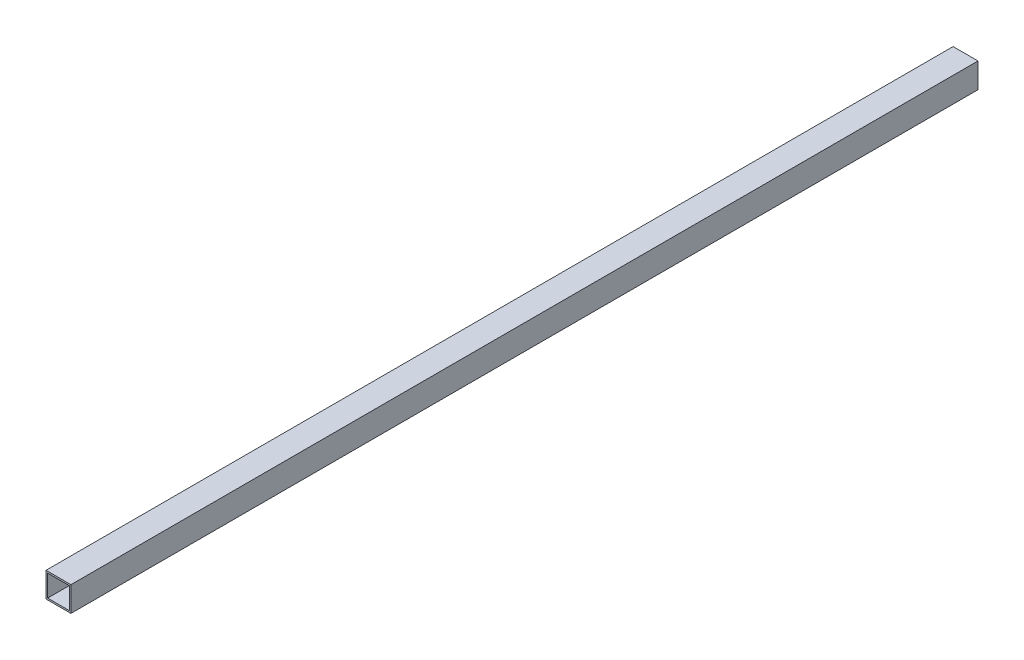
ISO-10303-21;
HEADER;
FILE_DESCRIPTION(('STEP AP214'),'2;1');
FILE_NAME('part.step','',(''),(''),'','','');
FILE_SCHEMA(('AUTOMOTIVE_DESIGN { 1 0 10303 214 1 1 1 1 }'));
ENDSEC;
DATA;
#1=APPLICATION_CONTEXT('core data for automotive mechanical design processes');
#2=APPLICATION_PROTOCOL_DEFINITION('international standard','automotive_design',2000,#1);
#3=PRODUCT_CONTEXT('',#1,'mechanical');
#4=PRODUCT('Part','Part','',(#3));
#5=PRODUCT_RELATED_PRODUCT_CATEGORY('part','',(#4));
#6=PRODUCT_DEFINITION_FORMATION('','',#4);
#7=PRODUCT_DEFINITION_CONTEXT('part definition',#1,'design');
#8=PRODUCT_DEFINITION('design','',#6,#7);
#9=PRODUCT_DEFINITION_SHAPE('','',#8);
#10=(LENGTH_UNIT() NAMED_UNIT(*) SI_UNIT(.MILLI.,.METRE.));
#11=(NAMED_UNIT(*) PLANE_ANGLE_UNIT() SI_UNIT($,.RADIAN.));
#12=(NAMED_UNIT(*) SI_UNIT($,.STERADIAN.) SOLID_ANGLE_UNIT());
#13=UNCERTAINTY_MEASURE_WITH_UNIT(LENGTH_MEASURE(1.E-05),#10,'distance_accuracy_value','');
#14=(GEOMETRIC_REPRESENTATION_CONTEXT(3) GLOBAL_UNCERTAINTY_ASSIGNED_CONTEXT((#13)) GLOBAL_UNIT_ASSIGNED_CONTEXT((#10,
#11,#12)) REPRESENTATION_CONTEXT('',''));
#15=CARTESIAN_POINT('',(0.,0.,0.));
#16=DIRECTION('',(0.,0.,1.));
#17=DIRECTION('',(1.,0.,0.));
#18=AXIS2_PLACEMENT_3D('',#15,#16,#17);
#19=CARTESIAN_POINT('',(-15.,-15.,1092.));
#20=DIRECTION('',(0.,0.,1.));
#21=DIRECTION('',(1.,0.,0.));
#22=AXIS2_PLACEMENT_3D('',#19,#20,#21);
#23=PLANE('',#22);
#24=DIRECTION('',(0.,-1.,0.));
#25=VECTOR('',#24,1.);
#26=CARTESIAN_POINT('',(-15.,15.,1092.));
#27=LINE('',#26,#25);
#28=CARTESIAN_POINT('',(-15.,15.,1092.));
#29=VERTEX_POINT('',#28);
#30=CARTESIAN_POINT('',(-15.,-15.,1092.));
#31=VERTEX_POINT('',#30);
#32=EDGE_CURVE('E155',#29,#31,#27,.T.);
#33=ORIENTED_EDGE('',*,*,#32,.T.);
#34=DIRECTION('',(1.,0.,0.));
#35=VECTOR('',#34,1.);
#36=CARTESIAN_POINT('',(-15.,-15.,1092.));
#37=LINE('',#36,#35);
#38=CARTESIAN_POINT('',(15.,-15.,1092.));
#39=VERTEX_POINT('',#38);
#40=EDGE_CURVE('E158',#31,#39,#37,.T.);
#41=ORIENTED_EDGE('',*,*,#40,.T.);
#42=DIRECTION('',(0.,1.,0.));
#43=VECTOR('',#42,1.);
#44=CARTESIAN_POINT('',(15.,15.,1092.));
#45=LINE('',#44,#43);
#46=CARTESIAN_POINT('',(15.,15.,1092.));
#47=VERTEX_POINT('',#46);
#48=EDGE_CURVE('E161',#39,#47,#45,.T.);
#49=ORIENTED_EDGE('',*,*,#48,.T.);
#50=DIRECTION('',(-1.,0.,0.));
#51=VECTOR('',#50,1.);
#52=CARTESIAN_POINT('',(-15.,15.,1092.));
#53=LINE('',#52,#51);
#54=EDGE_CURVE('E163',#47,#29,#53,.T.);
#55=ORIENTED_EDGE('',*,*,#54,.T.);
#56=EDGE_LOOP('',(#33,#41,#49,#55));
#57=FACE_BOUND('',#56,.T.);
#58=DIRECTION('',(1.,0.,0.));
#59=VECTOR('',#58,1.);
#60=CARTESIAN_POINT('',(-15.,-13.,1092.));
#61=LINE('',#60,#59);
#62=CARTESIAN_POINT('',(-13.,-13.,1092.));
#63=VERTEX_POINT('',#62);
#64=CARTESIAN_POINT('',(13.,-13.,1092.));
#65=VERTEX_POINT('',#64);
#66=EDGE_CURVE('E127',#63,#65,#61,.T.);
#67=ORIENTED_EDGE('',*,*,#66,.F.);
#68=DIRECTION('',(0.,-1.,0.));
#69=VECTOR('',#68,1.);
#70=CARTESIAN_POINT('',(-13.,15.,1092.));
#71=LINE('',#70,#69);
#72=CARTESIAN_POINT('',(-13.,13.,1092.));
#73=VERTEX_POINT('',#72);
#74=EDGE_CURVE('E119',#73,#63,#71,.T.);
#75=ORIENTED_EDGE('',*,*,#74,.F.);
#76=DIRECTION('',(-1.,0.,0.));
#77=VECTOR('',#76,1.);
#78=CARTESIAN_POINT('',(-15.,13.,1092.));
#79=LINE('',#78,#77);
#80=CARTESIAN_POINT('',(13.,13.,1092.));
#81=VERTEX_POINT('',#80);
#82=EDGE_CURVE('E141',#81,#73,#79,.T.);
#83=ORIENTED_EDGE('',*,*,#82,.F.);
#84=DIRECTION('',(0.,1.,0.));
#85=VECTOR('',#84,1.);
#86=CARTESIAN_POINT('',(13.,15.,1092.));
#87=LINE('',#86,#85);
#88=EDGE_CURVE('E139',#65,#81,#87,.T.);
#89=ORIENTED_EDGE('',*,*,#88,.F.);
#90=EDGE_LOOP('',(#67,#75,#83,#89));
#91=FACE_BOUND('',#90,.T.);
#92=ADVANCED_FACE('F54',(#57,#91),#23,.T.);
#93=CARTESIAN_POINT('',(-15.,-15.,0.));
#94=DIRECTION('',(0.,0.,1.));
#95=DIRECTION('',(1.,0.,0.));
#96=AXIS2_PLACEMENT_3D('',#93,#94,#95);
#97=PLANE('',#96);
#98=DIRECTION('',(0.,-1.,0.));
#99=VECTOR('',#98,1.);
#100=CARTESIAN_POINT('',(-15.,15.,0.));
#101=LINE('',#100,#99);
#102=CARTESIAN_POINT('',(-15.,15.,0.));
#103=VERTEX_POINT('',#102);
#104=CARTESIAN_POINT('',(-15.,-15.,0.));
#105=VERTEX_POINT('',#104);
#106=EDGE_CURVE('E135',#103,#105,#101,.T.);
#107=ORIENTED_EDGE('',*,*,#106,.F.);
#108=DIRECTION('',(-1.,0.,0.));
#109=VECTOR('',#108,1.);
#110=CARTESIAN_POINT('',(-15.,15.,0.));
#111=LINE('',#110,#109);
#112=CARTESIAN_POINT('',(15.,15.,0.));
#113=VERTEX_POINT('',#112);
#114=EDGE_CURVE('E159',#113,#103,#111,.T.);
#115=ORIENTED_EDGE('',*,*,#114,.F.);
#116=DIRECTION('',(0.,1.,0.));
#117=VECTOR('',#116,1.);
#118=CARTESIAN_POINT('',(15.,15.,0.));
#119=LINE('',#118,#117);
#120=CARTESIAN_POINT('',(15.,-15.,0.));
#121=VERTEX_POINT('',#120);
#122=EDGE_CURVE('E170',#121,#113,#119,.T.);
#123=ORIENTED_EDGE('',*,*,#122,.F.);
#124=DIRECTION('',(1.,0.,0.));
#125=VECTOR('',#124,1.);
#126=CARTESIAN_POINT('',(-15.,-15.,0.));
#127=LINE('',#126,#125);
#128=EDGE_CURVE('E168',#105,#121,#127,.T.);
#129=ORIENTED_EDGE('',*,*,#128,.F.);
#130=EDGE_LOOP('',(#107,#115,#123,#129));
#131=FACE_BOUND('',#130,.T.);
#132=DIRECTION('',(0.,-1.,0.));
#133=VECTOR('',#132,1.);
#134=CARTESIAN_POINT('',(-13.,15.,0.));
#135=LINE('',#134,#133);
#136=CARTESIAN_POINT('',(-13.,13.,0.));
#137=VERTEX_POINT('',#136);
#138=CARTESIAN_POINT('',(-13.,-13.,0.));
#139=VERTEX_POINT('',#138);
#140=EDGE_CURVE('E77',#137,#139,#135,.T.);
#141=ORIENTED_EDGE('',*,*,#140,.T.);
#142=DIRECTION('',(1.,0.,0.));
#143=VECTOR('',#142,1.);
#144=CARTESIAN_POINT('',(-15.,-13.,0.));
#145=LINE('',#144,#143);
#146=CARTESIAN_POINT('',(13.,-13.,0.));
#147=VERTEX_POINT('',#146);
#148=EDGE_CURVE('E134',#139,#147,#145,.T.);
#149=ORIENTED_EDGE('',*,*,#148,.T.);
#150=DIRECTION('',(0.,1.,0.));
#151=VECTOR('',#150,1.);
#152=CARTESIAN_POINT('',(13.,15.,0.));
#153=LINE('',#152,#151);
#154=CARTESIAN_POINT('',(13.,13.,0.));
#155=VERTEX_POINT('',#154);
#156=EDGE_CURVE('E147',#147,#155,#153,.T.);
#157=ORIENTED_EDGE('',*,*,#156,.T.);
#158=DIRECTION('',(-1.,0.,0.));
#159=VECTOR('',#158,1.);
#160=CARTESIAN_POINT('',(-15.,13.,0.));
#161=LINE('',#160,#159);
#162=EDGE_CURVE('E128',#155,#137,#161,.T.);
#163=ORIENTED_EDGE('',*,*,#162,.T.);
#164=EDGE_LOOP('',(#141,#149,#157,#163));
#165=FACE_BOUND('',#164,.T.);
#166=ADVANCED_FACE('F188',(#131,#165),#97,.F.);
#167=CARTESIAN_POINT('',(-15.,15.,1092.));
#168=DIRECTION('',(1.,0.,0.));
#169=DIRECTION('',(0.,1.,0.));
#170=AXIS2_PLACEMENT_3D('',#167,#168,#169);
#171=PLANE('',#170);
#172=ORIENTED_EDGE('',*,*,#106,.T.);
#173=DIRECTION('',(0.,0.,-1.));
#174=VECTOR('',#173,1.);
#175=CARTESIAN_POINT('',(-15.,-15.,1092.));
#176=LINE('',#175,#174);
#177=EDGE_CURVE('E12',#31,#105,#176,.T.);
#178=ORIENTED_EDGE('',*,*,#177,.F.);
#179=ORIENTED_EDGE('',*,*,#32,.F.);
#180=DIRECTION('',(0.,0.,-1.));
#181=VECTOR('',#180,1.);
#182=CARTESIAN_POINT('',(-15.,15.,1092.));
#183=LINE('',#182,#181);
#184=EDGE_CURVE('E165',#29,#103,#183,.T.);
#185=ORIENTED_EDGE('',*,*,#184,.T.);
#186=EDGE_LOOP('',(#172,#178,#179,#185));
#187=FACE_BOUND('',#186,.T.);
#188=ADVANCED_FACE('F56',(#187),#171,.F.);
#189=CARTESIAN_POINT('',(-15.,-15.,1092.));
#190=DIRECTION('',(0.,1.,0.));
#191=DIRECTION('',(-1.,0.,0.));
#192=AXIS2_PLACEMENT_3D('',#189,#190,#191);
#193=PLANE('',#192);
#194=ORIENTED_EDGE('',*,*,#128,.T.);
#195=DIRECTION('',(0.,0.,-1.));
#196=VECTOR('',#195,1.);
#197=CARTESIAN_POINT('',(15.,-15.,1092.));
#198=LINE('',#197,#196);
#199=EDGE_CURVE('E62',#39,#121,#198,.T.);
#200=ORIENTED_EDGE('',*,*,#199,.F.);
#201=ORIENTED_EDGE('',*,*,#40,.F.);
#202=ORIENTED_EDGE('',*,*,#177,.T.);
#203=EDGE_LOOP('',(#194,#200,#201,#202));
#204=FACE_BOUND('',#203,.T.);
#205=ADVANCED_FACE('F198',(#204),#193,.F.);
#206=CARTESIAN_POINT('',(15.,15.,1092.));
#207=DIRECTION('',(-1.,0.,0.));
#208=DIRECTION('',(0.,0.,1.));
#209=AXIS2_PLACEMENT_3D('',#206,#207,#208);
#210=PLANE('',#209);
#211=ORIENTED_EDGE('',*,*,#122,.T.);
#212=DIRECTION('',(0.,0.,-1.));
#213=VECTOR('',#212,1.);
#214=CARTESIAN_POINT('',(15.,15.,1092.));
#215=LINE('',#214,#213);
#216=EDGE_CURVE('E175',#47,#113,#215,.T.);
#217=ORIENTED_EDGE('',*,*,#216,.F.);
#218=ORIENTED_EDGE('',*,*,#48,.F.);
#219=ORIENTED_EDGE('',*,*,#199,.T.);
#220=EDGE_LOOP('',(#211,#217,#218,#219));
#221=FACE_BOUND('',#220,.T.);
#222=ADVANCED_FACE('F182',(#221),#210,.F.);
#223=CARTESIAN_POINT('',(-15.,15.,1092.));
#224=DIRECTION('',(0.,-1.,0.));
#225=DIRECTION('',(1.,0.,0.));
#226=AXIS2_PLACEMENT_3D('',#223,#224,#225);
#227=PLANE('',#226);
#228=ORIENTED_EDGE('',*,*,#114,.T.);
#229=ORIENTED_EDGE('',*,*,#184,.F.);
#230=ORIENTED_EDGE('',*,*,#54,.F.);
#231=ORIENTED_EDGE('',*,*,#216,.T.);
#232=EDGE_LOOP('',(#228,#229,#230,#231));
#233=FACE_BOUND('',#232,.T.);
#234=ADVANCED_FACE('F192',(#233),#227,.F.);
#235=CARTESIAN_POINT('',(-13.,15.,1092.));
#236=DIRECTION('',(1.,0.,0.));
#237=DIRECTION('',(0.,1.,0.));
#238=AXIS2_PLACEMENT_3D('',#235,#236,#237);
#239=PLANE('',#238);
#240=ORIENTED_EDGE('',*,*,#140,.F.);
#241=DIRECTION('',(0.,0.,-1.));
#242=VECTOR('',#241,1.);
#243=CARTESIAN_POINT('',(-13.,13.,1092.));
#244=LINE('',#243,#242);
#245=EDGE_CURVE('E123',#73,#137,#244,.T.);
#246=ORIENTED_EDGE('',*,*,#245,.F.);
#247=ORIENTED_EDGE('',*,*,#74,.T.);
#248=DIRECTION('',(0.,0.,-1.));
#249=VECTOR('',#248,1.);
#250=CARTESIAN_POINT('',(-13.,-13.,1092.));
#251=LINE('',#250,#249);
#252=EDGE_CURVE('E122',#63,#139,#251,.T.);
#253=ORIENTED_EDGE('',*,*,#252,.T.);
#254=EDGE_LOOP('',(#240,#246,#247,#253));
#255=FACE_BOUND('',#254,.T.);
#256=ADVANCED_FACE('F121',(#255),#239,.T.);
#257=CARTESIAN_POINT('',(-15.,-13.,1092.));
#258=DIRECTION('',(0.,1.,0.));
#259=DIRECTION('',(-1.,0.,0.));
#260=AXIS2_PLACEMENT_3D('',#257,#258,#259);
#261=PLANE('',#260);
#262=ORIENTED_EDGE('',*,*,#148,.F.);
#263=ORIENTED_EDGE('',*,*,#252,.F.);
#264=ORIENTED_EDGE('',*,*,#66,.T.);
#265=DIRECTION('',(0.,0.,-1.));
#266=VECTOR('',#265,1.);
#267=CARTESIAN_POINT('',(13.,-13.,1092.));
#268=LINE('',#267,#266);
#269=EDGE_CURVE('E136',#65,#147,#268,.T.);
#270=ORIENTED_EDGE('',*,*,#269,.T.);
#271=EDGE_LOOP('',(#262,#263,#264,#270));
#272=FACE_BOUND('',#271,.T.);
#273=ADVANCED_FACE('F131',(#272),#261,.T.);
#274=CARTESIAN_POINT('',(13.,15.,1092.));
#275=DIRECTION('',(-1.,0.,0.));
#276=DIRECTION('',(0.,0.,1.));
#277=AXIS2_PLACEMENT_3D('',#274,#275,#276);
#278=PLANE('',#277);
#279=ORIENTED_EDGE('',*,*,#156,.F.);
#280=ORIENTED_EDGE('',*,*,#269,.F.);
#281=ORIENTED_EDGE('',*,*,#88,.T.);
#282=DIRECTION('',(0.,0.,-1.));
#283=VECTOR('',#282,1.);
#284=CARTESIAN_POINT('',(13.,13.,1092.));
#285=LINE('',#284,#283);
#286=EDGE_CURVE('E69',#81,#155,#285,.T.);
#287=ORIENTED_EDGE('',*,*,#286,.T.);
#288=EDGE_LOOP('',(#279,#280,#281,#287));
#289=FACE_BOUND('',#288,.T.);
#290=ADVANCED_FACE('F221',(#289),#278,.T.);
#291=CARTESIAN_POINT('',(-15.,13.,1092.));
#292=DIRECTION('',(0.,-1.,0.));
#293=DIRECTION('',(1.,0.,0.));
#294=AXIS2_PLACEMENT_3D('',#291,#292,#293);
#295=PLANE('',#294);
#296=ORIENTED_EDGE('',*,*,#162,.F.);
#297=ORIENTED_EDGE('',*,*,#286,.F.);
#298=ORIENTED_EDGE('',*,*,#82,.T.);
#299=ORIENTED_EDGE('',*,*,#245,.T.);
#300=EDGE_LOOP('',(#296,#297,#298,#299));
#301=FACE_BOUND('',#300,.T.);
#302=ADVANCED_FACE('F225',(#301),#295,.T.);
#303=CLOSED_SHELL('',(#92,#166,#188,#205,#222,#234,#256,#273,#290,#302));
#304=MANIFOLD_SOLID_BREP('B2',#303);
#305=ADVANCED_BREP_SHAPE_REPRESENTATION('',(#18,#304),#14);
#306=SHAPE_DEFINITION_REPRESENTATION(#9,#305);
ENDSEC;
END-ISO-10303-21;
